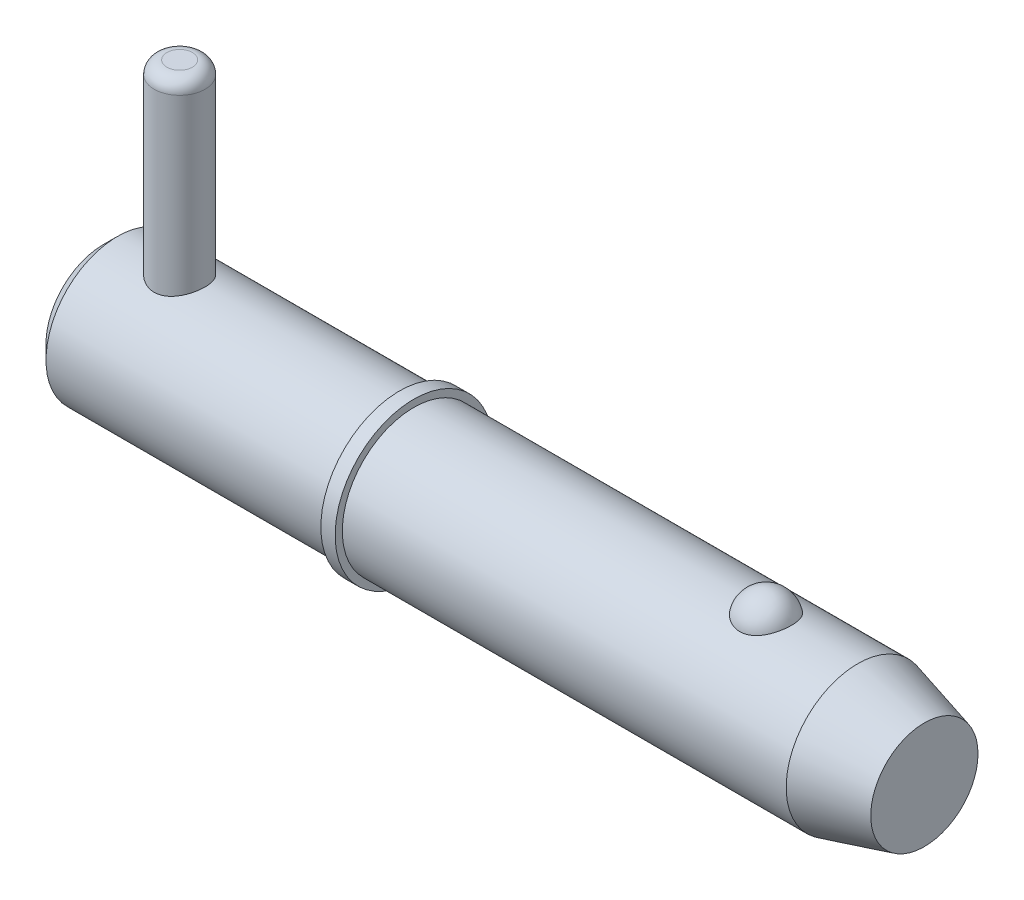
ISO-10303-21;
HEADER;
FILE_DESCRIPTION(('STEP AP214'),'2;1');
FILE_NAME('part.step','',(''),(''),'','','');
FILE_SCHEMA(('AUTOMOTIVE_DESIGN { 1 0 10303 214 1 1 1 1 }'));
ENDSEC;
DATA;
#1=APPLICATION_CONTEXT('core data for automotive mechanical design processes');
#2=APPLICATION_PROTOCOL_DEFINITION('international standard','automotive_design',2000,#1);
#3=PRODUCT_CONTEXT('',#1,'mechanical');
#4=PRODUCT('Part','Part','',(#3));
#5=PRODUCT_RELATED_PRODUCT_CATEGORY('part','',(#4));
#6=PRODUCT_DEFINITION_FORMATION('','',#4);
#7=PRODUCT_DEFINITION_CONTEXT('part definition',#1,'design');
#8=PRODUCT_DEFINITION('design','',#6,#7);
#9=PRODUCT_DEFINITION_SHAPE('','',#8);
#10=(LENGTH_UNIT() NAMED_UNIT(*) SI_UNIT(.MILLI.,.METRE.));
#11=(NAMED_UNIT(*) PLANE_ANGLE_UNIT() SI_UNIT($,.RADIAN.));
#12=(NAMED_UNIT(*) SI_UNIT($,.STERADIAN.) SOLID_ANGLE_UNIT());
#13=UNCERTAINTY_MEASURE_WITH_UNIT(LENGTH_MEASURE(1.E-05),#10,'distance_accuracy_value','');
#14=(GEOMETRIC_REPRESENTATION_CONTEXT(3) GLOBAL_UNCERTAINTY_ASSIGNED_CONTEXT((#13)) GLOBAL_UNIT_ASSIGNED_CONTEXT((#10,
#11,#12)) REPRESENTATION_CONTEXT('',''));
#15=CARTESIAN_POINT('',(0.,0.,0.));
#16=DIRECTION('',(0.,0.,1.));
#17=DIRECTION('',(1.,0.,0.));
#18=AXIS2_PLACEMENT_3D('',#15,#16,#17);
#19=CARTESIAN_POINT('',(5.94,19.845,0.));
#20=DIRECTION('',(0.,-1.,0.));
#21=DIRECTION('',(0.,0.,-1.));
#22=AXIS2_PLACEMENT_3D('',#19,#20,#21);
#23=CYLINDRICAL_SURFACE('',#22,1.98);
#24=CARTESIAN_POINT('',(5.94,-4.565,0.));
#25=DIRECTION('',(0.,1.,0.));
#26=DIRECTION('',(0.,0.,1.));
#27=AXIS2_PLACEMENT_3D('',#24,#25,#26);
#28=CIRCLE('',#27,1.98);
#29=CARTESIAN_POINT('',(5.94,-4.565,1.98));
#30=VERTEX_POINT('',#29);
#31=EDGE_CURVE('P0_E25',#30,#30,#28,.T.);
#32=ORIENTED_EDGE('',*,*,#31,.T.);
#33=EDGE_LOOP('',(#32));
#34=FACE_BOUND('',#33,.T.);
#35=CARTESIAN_POINT('',(5.94,18.855,0.));
#36=DIRECTION('',(0.,1.,0.));
#37=DIRECTION('',(0.,0.,1.));
#38=AXIS2_PLACEMENT_3D('',#35,#36,#37);
#39=CIRCLE('',#38,1.98);
#40=CARTESIAN_POINT('',(5.94,18.855,1.98));
#41=VERTEX_POINT('',#40);
#42=EDGE_CURVE('P0_E29',#41,#41,#39,.F.);
#43=ORIENTED_EDGE('',*,*,#42,.T.);
#44=EDGE_LOOP('',(#43));
#45=FACE_BOUND('',#44,.T.);
#46=ADVANCED_FACE('P0_F14',(#34,#45),#23,.T.);
#47=CARTESIAN_POINT('',(5.94,19.845,0.));
#48=DIRECTION('',(0.,1.,0.));
#49=DIRECTION('',(0.,0.,1.));
#50=AXIS2_PLACEMENT_3D('',#47,#48,#49);
#51=PLANE('',#50);
#52=CARTESIAN_POINT('',(5.94,19.845,0.));
#53=DIRECTION('',(0.,1.,0.));
#54=DIRECTION('',(0.,0.,1.));
#55=AXIS2_PLACEMENT_3D('',#52,#53,#54);
#56=CIRCLE('',#55,0.99);
#57=CARTESIAN_POINT('',(5.94,19.845,0.99));
#58=VERTEX_POINT('',#57);
#59=EDGE_CURVE('P0_E10',#58,#58,#56,.T.);
#60=ORIENTED_EDGE('',*,*,#59,.T.);
#61=EDGE_LOOP('',(#60));
#62=FACE_BOUND('',#61,.T.);
#63=ADVANCED_FACE('P0_F46',(#62),#51,.T.);
#64=CARTESIAN_POINT('',(5.94,-5.555,0.));
#65=DIRECTION('',(0.,1.,0.));
#66=DIRECTION('',(0.,0.,1.));
#67=AXIS2_PLACEMENT_3D('',#64,#65,#66);
#68=PLANE('',#67);
#69=CARTESIAN_POINT('',(5.94,-5.555,0.));
#70=DIRECTION('',(0.,1.,0.));
#71=DIRECTION('',(0.,0.,1.));
#72=AXIS2_PLACEMENT_3D('',#69,#70,#71);
#73=CIRCLE('',#72,0.99);
#74=CARTESIAN_POINT('',(5.94,-5.555,0.99));
#75=VERTEX_POINT('',#74);
#76=EDGE_CURVE('P0_E21',#75,#75,#73,.F.);
#77=ORIENTED_EDGE('',*,*,#76,.T.);
#78=EDGE_LOOP('',(#77));
#79=FACE_BOUND('',#78,.T.);
#80=ADVANCED_FACE('P0_F43',(#79),#68,.F.);
#81=CARTESIAN_POINT('',(5.94,-4.565,0.));
#82=DIRECTION('',(0.,1.,0.));
#83=DIRECTION('',(0.,0.,1.));
#84=AXIS2_PLACEMENT_3D('',#81,#82,#83);
#85=DEGENERATE_TOROIDAL_SURFACE('',#84,0.99,0.99,.T.);
#86=ORIENTED_EDGE('',*,*,#76,.F.);
#87=EDGE_LOOP('',(#86));
#88=FACE_BOUND('',#87,.T.);
#89=ORIENTED_EDGE('',*,*,#31,.F.);
#90=EDGE_LOOP('',(#89));
#91=FACE_BOUND('',#90,.T.);
#92=ADVANCED_FACE('P0_F38',(#88,#91),#85,.T.);
#93=CARTESIAN_POINT('',(5.94,18.855,0.));
#94=DIRECTION('',(0.,1.,0.));
#95=DIRECTION('',(0.,0.,1.));
#96=AXIS2_PLACEMENT_3D('',#93,#94,#95);
#97=DEGENERATE_TOROIDAL_SURFACE('',#96,0.99,0.99,.T.);
#98=ORIENTED_EDGE('',*,*,#42,.F.);
#99=EDGE_LOOP('',(#98));
#100=FACE_BOUND('',#99,.T.);
#101=ORIENTED_EDGE('',*,*,#59,.F.);
#102=EDGE_LOOP('',(#101));
#103=FACE_BOUND('',#102,.T.);
#104=ADVANCED_FACE('P0_F16',(#100,#103),#97,.T.);
#105=CLOSED_SHELL('',(#46,#63,#80,#92,#104));
#106=MANIFOLD_SOLID_BREP('P0_B1',#105);
#107=CARTESIAN_POINT('',(0.,0.,0.));
#108=DIRECTION('',(1.,0.,0.));
#109=DIRECTION('',(0.,0.,-1.));
#110=AXIS2_PLACEMENT_3D('',#107,#108,#109);
#111=CYLINDRICAL_SURFACE('',#110,5.555);
#112=CARTESIAN_POINT('',(58.6171144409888,0.,0.));
#113=DIRECTION('',(1.,0.,0.));
#114=DIRECTION('',(0.,0.,-1.));
#115=AXIS2_PLACEMENT_3D('',#112,#113,#114);
#116=CIRCLE('',#115,5.555);
#117=CARTESIAN_POINT('',(58.6171144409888,0.,-5.555));
#118=VERTEX_POINT('',#117);
#119=EDGE_CURVE('P1_E81',#118,#118,#116,.T.);
#120=ORIENTED_EDGE('',*,*,#119,.F.);
#121=EDGE_LOOP('',(#120));
#122=FACE_BOUND('',#121,.T.);
#123=CARTESIAN_POINT('',(24.13,0.,0.));
#124=DIRECTION('',(1.,0.,0.));
#125=DIRECTION('',(0.,0.,-1.));
#126=AXIS2_PLACEMENT_3D('',#123,#124,#125);
#127=CIRCLE('',#126,5.555);
#128=CARTESIAN_POINT('',(24.13,0.,-5.555));
#129=VERTEX_POINT('',#128);
#130=EDGE_CURVE('P1_E85',#129,#129,#127,.T.);
#131=ORIENTED_EDGE('',*,*,#130,.T.);
#132=EDGE_LOOP('',(#131));
#133=FACE_BOUND('',#132,.T.);
#134=CARTESIAN_POINT('',(51.4986264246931,5.16741224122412,2.03859650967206));
#135=CARTESIAN_POINT('',(51.3929492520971,5.16740893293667,2.03859990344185));
#136=CARTESIAN_POINT('',(51.28729894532,5.17079470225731,2.03008306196));
#137=CARTESIAN_POINT('',(51.0791419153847,5.18392795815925,1.99630721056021));
#138=CARTESIAN_POINT('',(50.9766344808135,5.19367399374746,1.97105201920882));
#139=CARTESIAN_POINT('',(50.7777710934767,5.21839168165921,1.90463997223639));
#140=CARTESIAN_POINT('',(50.6814064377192,5.23335573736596,1.86350622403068));
#141=CARTESIAN_POINT('',(50.4970804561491,5.26688076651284,1.76652592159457));
#142=CARTESIAN_POINT('',(50.4091207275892,5.28544242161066,1.71067657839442));
#143=CARTESIAN_POINT('',(50.2412654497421,5.32479845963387,1.58399959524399));
#144=CARTESIAN_POINT('',(50.1616656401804,5.34564089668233,1.51279545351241));
#145=CARTESIAN_POINT('',(50.0151290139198,5.38697258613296,1.35828584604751));
#146=CARTESIAN_POINT('',(49.948194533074,5.40746177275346,1.27497815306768));
#147=CARTESIAN_POINT('',(49.8256103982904,5.44694508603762,1.09440293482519));
#148=CARTESIAN_POINT('',(49.7705989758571,5.46583143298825,0.996677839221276));
#149=CARTESIAN_POINT('',(49.6769376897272,5.49908030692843,0.792961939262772));
#150=CARTESIAN_POINT('',(49.6382894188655,5.513442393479,0.686970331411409));
#151=CARTESIAN_POINT('',(49.5776807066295,5.53635851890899,0.46801974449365));
#152=CARTESIAN_POINT('',(49.5559725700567,5.54482455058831,0.3549815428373));
#153=CARTESIAN_POINT('',(49.5306362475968,5.55473324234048,0.126595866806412));
#154=CARTESIAN_POINT('',(49.5270077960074,5.55617600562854,0.0112484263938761));
#155=CARTESIAN_POINT('',(49.5378817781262,5.55189984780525,-0.218011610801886));
#156=CARTESIAN_POINT('',(49.5523151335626,5.54620821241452,-0.331928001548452));
#157=CARTESIAN_POINT('',(49.598903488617,5.52828920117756,-0.555544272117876));
#158=CARTESIAN_POINT('',(49.6310588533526,5.5160616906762,-0.665244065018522));
#159=CARTESIAN_POINT('',(49.7124883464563,5.48630779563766,-0.877469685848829));
#160=CARTESIAN_POINT('',(49.7617816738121,5.4687754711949,-0.979987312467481));
#161=CARTESIAN_POINT('',(49.8764785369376,5.43024700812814,-1.1748697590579));
#162=CARTESIAN_POINT('',(49.9418831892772,5.4092506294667,-1.26723387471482));
#163=CARTESIAN_POINT('',(50.0875712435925,5.36600927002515,-1.4394013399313));
#164=CARTESIAN_POINT('',(50.1678859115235,5.34376173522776,-1.51917763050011));
#165=CARTESIAN_POINT('',(50.3414520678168,5.30057971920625,-1.66360338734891));
#166=CARTESIAN_POINT('',(50.434702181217,5.27964509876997,-1.72825445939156));
#167=CARTESIAN_POINT('',(50.6293939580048,5.24205250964,-1.83909478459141));
#168=CARTESIAN_POINT('',(50.7305900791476,5.22530519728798,-1.88568407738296));
#169=CARTESIAN_POINT('',(50.9401552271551,5.1975091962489,-1.96100802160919));
#170=CARTESIAN_POINT('',(51.0485215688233,5.1864583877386,-1.98974931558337));
#171=CARTESIAN_POINT('',(51.2634989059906,5.17184410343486,-2.02742262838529));
#172=CARTESIAN_POINT('',(51.369925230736,5.1679328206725,-2.03727608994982));
#173=CARTESIAN_POINT('',(51.5829925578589,5.16698995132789,-2.03966777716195));
#174=CARTESIAN_POINT('',(51.6896335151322,5.16995704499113,-2.03220932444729));
#175=CARTESIAN_POINT('',(51.8967730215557,5.18222383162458,-2.00071170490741));
#176=CARTESIAN_POINT('',(51.9973599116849,5.19133213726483,-1.97717337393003));
#177=CARTESIAN_POINT('',(52.1930141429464,5.21467637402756,-1.91475248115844));
#178=CARTESIAN_POINT('',(52.2880810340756,5.22891272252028,-1.8758686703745));
#179=CARTESIAN_POINT('',(52.4723711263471,5.26137066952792,-1.7828271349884));
#180=CARTESIAN_POINT('',(52.5614190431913,5.27967329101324,-1.72835124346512));
#181=CARTESIAN_POINT('',(52.7292880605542,5.3181741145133,-1.60597483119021));
#182=CARTESIAN_POINT('',(52.8081068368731,5.33837274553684,-1.53807126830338));
#183=CARTESIAN_POINT('',(52.9575156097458,5.37968287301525,-1.38688970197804));
#184=CARTESIAN_POINT('',(53.0275058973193,5.40079011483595,-1.30301744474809));
#185=CARTESIAN_POINT('',(53.1530125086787,5.44074401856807,-1.12458170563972));
#186=CARTESIAN_POINT('',(53.2085262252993,5.4595902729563,-1.03001630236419));
#187=CARTESIAN_POINT('',(53.3055507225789,5.49369849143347,-0.829439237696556));
#188=CARTESIAN_POINT('',(53.3465483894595,5.50882422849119,-0.723155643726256));
#189=CARTESIAN_POINT('',(53.4111250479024,5.53310911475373,-0.50477271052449));
#190=CARTESIAN_POINT('',(53.4347036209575,5.54226812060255,-0.392673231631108));
#191=CARTESIAN_POINT('',(53.464013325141,5.55370358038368,-0.165459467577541));
#192=CARTESIAN_POINT('',(53.4696884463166,5.55595843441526,-0.0503368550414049));
#193=CARTESIAN_POINT('',(53.462916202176,5.55329317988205,0.179288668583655));
#194=CARTESIAN_POINT('',(53.4504690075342,5.54837313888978,0.293791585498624));
#195=CARTESIAN_POINT('',(53.4077798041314,5.53189037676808,0.518526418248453));
#196=CARTESIAN_POINT('',(53.377598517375,5.5203503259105,0.62877154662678));
#197=CARTESIAN_POINT('',(53.3000962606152,5.49182453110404,0.84231815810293));
#198=CARTESIAN_POINT('',(53.2527743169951,5.47483847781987,0.945619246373));
#199=CARTESIAN_POINT('',(53.1417204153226,5.43710633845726,1.14281571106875));
#200=CARTESIAN_POINT('',(53.077921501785,5.41634501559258,1.23667048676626));
#201=CARTESIAN_POINT('',(52.9353577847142,5.37334572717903,1.41185243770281));
#202=CARTESIAN_POINT('',(52.8565932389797,5.35110778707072,1.49317982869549));
#203=CARTESIAN_POINT('',(52.6864234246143,5.30779474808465,1.64049162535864));
#204=CARTESIAN_POINT('',(52.5951002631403,5.28671324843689,1.70656877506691));
#205=CARTESIAN_POINT('',(52.4017390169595,5.24804852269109,1.82201372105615));
#206=CARTESIAN_POINT('',(52.2997005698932,5.23046541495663,1.87138095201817));
#207=CARTESIAN_POINT('',(52.0836187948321,5.20042692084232,1.95335298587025));
#208=CARTESIAN_POINT('',(51.9692602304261,5.18820192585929,1.98521734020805));
#209=CARTESIAN_POINT('',(51.7361307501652,5.17169804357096,2.02783294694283));
#210=CARTESIAN_POINT('',(51.6173616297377,5.16741595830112,2.03859269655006));
#211=CARTESIAN_POINT('',(51.4986264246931,5.16741224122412,2.03859650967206));
#212=B_SPLINE_CURVE_WITH_KNOTS('',3,(#134,#135,#136,#137,#138,#139,#140,#141,#142,#143,#144,
#145,#146,#147,#148,#149,#150,#151,#152,#153,#154,#155,#156,#157,#158,#159,#160,#161,#162,#163,
#164,#165,#166,#167,#168,#169,#170,#171,#172,#173,#174,#175,#176,#177,#178,#179,#180,#181,#182,
#183,#184,#185,#186,#187,#188,#189,#190,#191,#192,#193,#194,#195,#196,#197,#198,#199,#200,#201,
#202,#203,#204,#205,#206,#207,#208,#209,#210,#211),.UNSPECIFIED.,.T.,.F.,(4,2,2,2,2,2,2,2,2,2,2,
2,2,2,2,2,2,2,2,2,2,2,2,2,2,2,2,2,2,2,2,2,2,2,2,2,2,2,4),(0.,0.316595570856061,
0.633118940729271,0.949183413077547,1.26530783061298,1.59030762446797,1.9153672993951,
2.25495824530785,2.59458224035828,2.93917283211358,3.28375835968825,3.62703002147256,
3.97030875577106,4.31397329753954,4.657661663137,5.00207904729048,5.34645984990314,
5.68270547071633,6.01882587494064,6.33808403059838,6.65728093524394,6.96696376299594,
7.27667180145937,7.59321535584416,7.90983070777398,8.24210387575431,8.57443684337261,
8.91755896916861,9.2606893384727,9.60489211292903,9.94909164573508,10.2921194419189,
10.6351667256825,10.9796305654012,11.3240884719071,11.6663928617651,12.0087088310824,
12.3645679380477,12.7202837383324),.UNSPECIFIED.);
#213=CARTESIAN_POINT('',(51.4986264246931,5.16741224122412,2.03859650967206));
#214=VERTEX_POINT('',#213);
#215=EDGE_CURVE('P1_E35',#214,#214,#212,.T.);
#216=ORIENTED_EDGE('',*,*,#215,.T.);
#217=EDGE_LOOP('',(#216));
#218=FACE_BOUND('',#217,.T.);
#219=ADVANCED_FACE('P1_F13',(#122,#133,#218),#111,.T.);
#220=CARTESIAN_POINT('',(0.,0.,0.));
#221=DIRECTION('',(-1.,0.,0.));
#222=DIRECTION('',(0.,0.,1.));
#223=AXIS2_PLACEMENT_3D('',#220,#221,#222);
#224=PLANE('',#223);
#225=CARTESIAN_POINT('',(0.,0.,0.));
#226=DIRECTION('',(1.,0.,0.));
#227=DIRECTION('',(0.,0.,-1.));
#228=AXIS2_PLACEMENT_3D('',#225,#226,#227);
#229=CIRCLE('',#228,4.444);
#230=CARTESIAN_POINT('',(0.,0.,-4.444));
#231=VERTEX_POINT('',#230);
#232=EDGE_CURVE('P1_E9',#231,#231,#229,.T.);
#233=ORIENTED_EDGE('',*,*,#232,.F.);
#234=EDGE_LOOP('',(#233));
#235=FACE_BOUND('',#234,.T.);
#236=ADVANCED_FACE('P1_F15',(#235),#224,.T.);
#237=CARTESIAN_POINT('',(1.111,0.,0.));
#238=DIRECTION('',(1.,0.,0.));
#239=DIRECTION('',(0.,0.,-1.));
#240=AXIS2_PLACEMENT_3D('',#237,#238,#239);
#241=CONICAL_SURFACE('',#240,5.555,0.78539816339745);
#242=ORIENTED_EDGE('',*,*,#232,.T.);
#243=EDGE_LOOP('',(#242));
#244=FACE_BOUND('',#243,.T.);
#245=CARTESIAN_POINT('',(1.111,0.,0.));
#246=DIRECTION('',(1.,0.,0.));
#247=DIRECTION('',(0.,0.,-1.));
#248=AXIS2_PLACEMENT_3D('',#245,#246,#247);
#249=CIRCLE('',#248,5.555);
#250=CARTESIAN_POINT('',(1.111,0.,-5.555));
#251=VERTEX_POINT('',#250);
#252=EDGE_CURVE('P1_E26',#251,#251,#249,.T.);
#253=ORIENTED_EDGE('',*,*,#252,.F.);
#254=EDGE_LOOP('',(#253));
#255=FACE_BOUND('',#254,.T.);
#256=ADVANCED_FACE('P1_F77',(#244,#255),#241,.T.);
#257=CARTESIAN_POINT('',(0.,0.,0.));
#258=DIRECTION('',(1.,0.,0.));
#259=DIRECTION('',(0.,0.,-1.));
#260=AXIS2_PLACEMENT_3D('',#257,#258,#259);
#261=CYLINDRICAL_SURFACE('',#260,5.555);
#262=CARTESIAN_POINT('',(5.94,-5.19014691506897,1.98));
#263=CARTESIAN_POINT('',(5.83264687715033,-5.19014494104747,1.98000226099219));
#264=CARTESIAN_POINT('',(5.7253094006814,-5.19351395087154,1.97123988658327));
#265=CARTESIAN_POINT('',(5.51384517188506,-5.20654291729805,1.93656219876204));
#266=CARTESIAN_POINT('',(5.40971858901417,-5.21620320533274,1.91064598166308));
#267=CARTESIAN_POINT('',(5.20778082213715,-5.24058443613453,1.84271148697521));
#268=CARTESIAN_POINT('',(5.10995634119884,-5.25529427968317,1.80072850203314));
#269=CARTESIAN_POINT('',(4.92270352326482,-5.28810012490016,1.70197537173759));
#270=CARTESIAN_POINT('',(4.83327743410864,-5.3061970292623,1.64520128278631));
#271=CARTESIAN_POINT('',(4.66135184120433,-5.34464714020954,1.51575187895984));
#272=CARTESIAN_POINT('',(4.57928277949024,-5.36506222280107,1.44252311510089));
#273=CARTESIAN_POINT('',(4.42829115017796,-5.40532920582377,1.28342047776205));
#274=CARTESIAN_POINT('',(4.35937105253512,-5.42518099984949,1.19754423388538));
#275=CARTESIAN_POINT('',(4.23461605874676,-5.46281133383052,1.01237205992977));
#276=CARTESIAN_POINT('',(4.17924129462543,-5.48050875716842,0.912748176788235));
#277=CARTESIAN_POINT('',(4.0862117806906,-5.51109938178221,0.70485824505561));
#278=CARTESIAN_POINT('',(4.0485515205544,-5.52399407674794,0.596594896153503));
#279=CARTESIAN_POINT('',(3.99350662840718,-5.54308759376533,0.379019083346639));
#280=CARTESIAN_POINT('',(3.97538263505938,-5.54952987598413,0.269915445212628));
#281=CARTESIAN_POINT('',(3.95756405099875,-5.55586205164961,0.0500378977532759));
#282=CARTESIAN_POINT('',(3.95786404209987,-5.55575387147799,-0.060735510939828));
#283=CARTESIAN_POINT('',(3.97643665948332,-5.54915684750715,-0.275539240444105));
#284=CARTESIAN_POINT('',(3.99390415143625,-5.54295384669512,-0.379649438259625));
#285=CARTESIAN_POINT('',(4.0449721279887,-5.52523170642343,-0.583350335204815));
#286=CARTESIAN_POINT('',(4.07857373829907,-5.51371219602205,-0.682940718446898));
#287=CARTESIAN_POINT('',(4.16137312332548,-5.4863099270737,-0.876423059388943));
#288=CARTESIAN_POINT('',(4.2107826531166,-5.47036834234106,-0.970215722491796));
#289=CARTESIAN_POINT('',(4.32361427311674,-5.43575653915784,-1.1484017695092));
#290=CARTESIAN_POINT('',(4.38704062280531,-5.41708549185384,-1.23279228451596));
#291=CARTESIAN_POINT('',(4.53006791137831,-5.37778429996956,-1.39454579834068));
#292=CARTESIAN_POINT('',(4.61035105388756,-5.35710277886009,-1.4712940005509));
#293=CARTESIAN_POINT('',(4.78279835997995,-5.31692766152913,-1.6104545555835));
#294=CARTESIAN_POINT('',(4.874964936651,-5.29743430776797,-1.67286398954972));
#295=CARTESIAN_POINT('',(5.07076688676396,-5.26153775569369,-1.78259698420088));
#296=CARTESIAN_POINT('',(5.17458163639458,-5.24519780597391,-1.8296227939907));
#297=CARTESIAN_POINT('',(5.38938990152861,-5.21818744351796,-1.90530278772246));
#298=CARTESIAN_POINT('',(5.50037985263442,-5.20751423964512,-1.93396601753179));
#299=CARTESIAN_POINT('',(5.72036376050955,-5.19369176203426,-1.97077654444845));
#300=CARTESIAN_POINT('',(5.82917370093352,-5.19018851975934,-1.97989015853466));
#301=CARTESIAN_POINT('',(6.04680100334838,-5.19010609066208,-1.98010779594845));
#302=CARTESIAN_POINT('',(6.15561835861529,-5.19352540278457,-1.97121572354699));
#303=CARTESIAN_POINT('',(6.36548036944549,-5.20654623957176,-1.93654727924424));
#304=CARTESIAN_POINT('',(6.46666051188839,-5.21588705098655,-1.91148218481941));
#305=CARTESIAN_POINT('',(6.66334537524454,-5.23939939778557,-1.84605494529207));
#306=CARTESIAN_POINT('',(6.75884899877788,-5.25357186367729,-1.8056898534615));
#307=CARTESIAN_POINT('',(6.94517989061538,-5.28576258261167,-1.70921153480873));
#308=CARTESIAN_POINT('',(7.03572661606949,-5.30389804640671,-1.65259670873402));
#309=CARTESIAN_POINT('',(7.20638087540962,-5.34176077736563,-1.52577523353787));
#310=CARTESIAN_POINT('',(7.28648490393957,-5.36148857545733,-1.45556404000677));
#311=CARTESIAN_POINT('',(7.43864697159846,-5.40165494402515,-1.2988614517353));
#312=CARTESIAN_POINT('',(7.50999887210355,-5.42207106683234,-1.21167640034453));
#313=CARTESIAN_POINT('',(7.63712639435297,-5.46023601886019,-1.026066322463));
#314=CARTESIAN_POINT('',(7.69290228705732,-5.47798489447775,-0.927641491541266));
#315=CARTESIAN_POINT('',(7.78684673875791,-5.50876590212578,-0.722633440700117));
#316=CARTESIAN_POINT('',(7.82510508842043,-5.52182201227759,-0.616095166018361));
#317=CARTESIAN_POINT('',(7.88297051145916,-5.54184206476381,-0.397530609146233));
#318=CARTESIAN_POINT('',(7.90258540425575,-5.5488085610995,-0.285506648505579));
#319=CARTESIAN_POINT('',(7.9218262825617,-5.55564472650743,-0.065566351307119));
#320=CARTESIAN_POINT('',(7.92245987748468,-5.55587212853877,0.0422515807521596));
#321=CARTESIAN_POINT('',(7.90626329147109,-5.55011340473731,0.256387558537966));
#322=CARTESIAN_POINT('',(7.88943488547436,-5.54412791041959,0.362705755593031));
#323=CARTESIAN_POINT('',(7.83948457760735,-5.52676548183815,0.568649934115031));
#324=CARTESIAN_POINT('',(7.8067003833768,-5.51550046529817,0.668367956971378));
#325=CARTESIAN_POINT('',(7.72609369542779,-5.48874437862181,0.860911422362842));
#326=CARTESIAN_POINT('',(7.67826838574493,-5.47325251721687,0.953735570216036));
#327=CARTESIAN_POINT('',(7.56675024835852,-5.43884382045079,1.13391068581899));
#328=CARTESIAN_POINT('',(7.50249968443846,-5.41981485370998,1.22089468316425));
#329=CARTESIAN_POINT('',(7.36086495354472,-5.38069275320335,1.38316665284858));
#330=CARTESIAN_POINT('',(7.28347630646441,-5.36059925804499,1.45845061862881));
#331=CARTESIAN_POINT('',(7.11347587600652,-5.32048380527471,1.59876646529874));
#332=CARTESIAN_POINT('',(7.02032386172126,-5.30050854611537,1.66315951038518));
#333=CARTESIAN_POINT('',(6.82388804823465,-5.26398994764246,1.77536801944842));
#334=CARTESIAN_POINT('',(6.7206049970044,-5.24744635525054,1.82318470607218));
#335=CARTESIAN_POINT('',(6.50639706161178,-5.21987969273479,1.90068230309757));
#336=CARTESIAN_POINT('',(6.3954529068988,-5.20887116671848,1.93031547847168));
#337=CARTESIAN_POINT('',(6.16966522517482,-5.19400760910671,1.96996824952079));
#338=CARTESIAN_POINT('',(6.05482366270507,-5.19014902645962,1.97999758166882));
#339=CARTESIAN_POINT('',(5.94,-5.19014691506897,1.98));
#340=B_SPLINE_CURVE_WITH_KNOTS('',3,(#262,#263,#264,#265,#266,#267,#268,#269,#270,#271,#272,
#273,#274,#275,#276,#277,#278,#279,#280,#281,#282,#283,#284,#285,#286,#287,#288,#289,#290,#291,
#292,#293,#294,#295,#296,#297,#298,#299,#300,#301,#302,#303,#304,#305,#306,#307,#308,#309,#310,
#311,#312,#313,#314,#315,#316,#317,#318,#319,#320,#321,#322,#323,#324,#325,#326,#327,#328,#329,
#330,#331,#332,#333,#334,#335,#336,#337,#338,#339),.UNSPECIFIED.,.T.,.F.,(4,2,2,2,2,2,2,2,2,2,2,
2,2,2,2,2,2,2,2,2,2,2,2,2,2,2,2,2,2,2,2,2,2,2,2,2,2,2,4),(0.,0.321632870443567,
0.643282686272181,0.964229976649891,1.28526292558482,1.61937087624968,1.9535415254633,
2.29784481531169,2.64204093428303,2.97269632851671,3.30325448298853,3.61901541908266,
3.93479838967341,4.25500220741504,4.57530346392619,4.91268648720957,5.25013812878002,
5.59378026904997,5.93725299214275,6.26331481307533,6.58930593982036,6.90185604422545,
7.21446637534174,7.53801472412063,7.86167140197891,8.20353561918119,8.54539388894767,
8.88547970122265,9.22542281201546,9.54728637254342,9.86911722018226,10.1844146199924,
10.4997710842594,10.827730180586,11.1558013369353,11.499115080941,11.8424034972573,
12.1865892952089,12.5306041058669),.UNSPECIFIED.);
#341=CARTESIAN_POINT('',(5.94,-5.19014691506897,1.98));
#342=VERTEX_POINT('',#341);
#343=EDGE_CURVE('P1_E17',#342,#342,#340,.T.);
#344=ORIENTED_EDGE('',*,*,#343,.F.);
#345=EDGE_LOOP('',(#344));
#346=FACE_BOUND('',#345,.T.);
#347=CARTESIAN_POINT('',(5.94,5.19014691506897,1.98));
#348=CARTESIAN_POINT('',(6.04735312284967,5.19014494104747,1.98000226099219));
#349=CARTESIAN_POINT('',(6.1546905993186,5.19351395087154,1.97123988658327));
#350=CARTESIAN_POINT('',(6.36615482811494,5.20654291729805,1.93656219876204));
#351=CARTESIAN_POINT('',(6.47028141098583,5.21620320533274,1.91064598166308));
#352=CARTESIAN_POINT('',(6.67221917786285,5.24058443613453,1.84271148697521));
#353=CARTESIAN_POINT('',(6.77004365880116,5.25529427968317,1.80072850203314));
#354=CARTESIAN_POINT('',(6.95729647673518,5.28810012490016,1.70197537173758));
#355=CARTESIAN_POINT('',(7.04672256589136,5.3061970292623,1.64520128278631));
#356=CARTESIAN_POINT('',(7.21864815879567,5.34464714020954,1.51575187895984));
#357=CARTESIAN_POINT('',(7.30071722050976,5.36506222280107,1.44252311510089));
#358=CARTESIAN_POINT('',(7.45170884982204,5.40532920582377,1.28342047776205));
#359=CARTESIAN_POINT('',(7.52062894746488,5.42518099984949,1.19754423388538));
#360=CARTESIAN_POINT('',(7.64538394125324,5.46281133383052,1.01237205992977));
#361=CARTESIAN_POINT('',(7.70075870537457,5.48050875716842,0.912748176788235));
#362=CARTESIAN_POINT('',(7.7937882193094,5.51109938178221,0.704858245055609));
#363=CARTESIAN_POINT('',(7.8314484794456,5.52399407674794,0.596594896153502));
#364=CARTESIAN_POINT('',(7.88649337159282,5.54308759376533,0.379019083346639));
#365=CARTESIAN_POINT('',(7.90461736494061,5.54952987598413,0.269915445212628));
#366=CARTESIAN_POINT('',(7.92243594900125,5.55586205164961,0.0500378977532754));
#367=CARTESIAN_POINT('',(7.92213595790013,5.55575387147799,-0.0607355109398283));
#368=CARTESIAN_POINT('',(7.90356334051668,5.54915684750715,-0.275539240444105));
#369=CARTESIAN_POINT('',(7.88609584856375,5.54295384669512,-0.379649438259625));
#370=CARTESIAN_POINT('',(7.8350278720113,5.52523170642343,-0.583350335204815));
#371=CARTESIAN_POINT('',(7.80142626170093,5.51371219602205,-0.682940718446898));
#372=CARTESIAN_POINT('',(7.71862687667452,5.4863099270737,-0.876423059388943));
#373=CARTESIAN_POINT('',(7.6692173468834,5.47036834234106,-0.970215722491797));
#374=CARTESIAN_POINT('',(7.55638572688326,5.43575653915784,-1.1484017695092));
#375=CARTESIAN_POINT('',(7.49295937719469,5.41708549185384,-1.23279228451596));
#376=CARTESIAN_POINT('',(7.34993208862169,5.37778429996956,-1.39454579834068));
#377=CARTESIAN_POINT('',(7.26964894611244,5.35710277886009,-1.4712940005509));
#378=CARTESIAN_POINT('',(7.09720164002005,5.31692766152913,-1.6104545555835));
#379=CARTESIAN_POINT('',(7.00503506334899,5.29743430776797,-1.67286398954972));
#380=CARTESIAN_POINT('',(6.80923311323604,5.26153775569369,-1.78259698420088));
#381=CARTESIAN_POINT('',(6.70541836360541,5.24519780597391,-1.8296227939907));
#382=CARTESIAN_POINT('',(6.49061009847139,5.21818744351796,-1.90530278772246));
#383=CARTESIAN_POINT('',(6.37962014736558,5.20751423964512,-1.93396601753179));
#384=CARTESIAN_POINT('',(6.15963623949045,5.19369176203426,-1.97077654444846));
#385=CARTESIAN_POINT('',(6.05082629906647,5.19018851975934,-1.97989015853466));
#386=CARTESIAN_POINT('',(5.83319899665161,5.19010609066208,-1.98010779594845));
#387=CARTESIAN_POINT('',(5.7243816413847,5.19352540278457,-1.97121572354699));
#388=CARTESIAN_POINT('',(5.5145196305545,5.20654623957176,-1.93654727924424));
#389=CARTESIAN_POINT('',(5.4133394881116,5.21588705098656,-1.91148218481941));
#390=CARTESIAN_POINT('',(5.21665462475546,5.23939939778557,-1.84605494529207));
#391=CARTESIAN_POINT('',(5.12115100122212,5.25357186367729,-1.8056898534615));
#392=CARTESIAN_POINT('',(4.93482010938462,5.28576258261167,-1.70921153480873));
#393=CARTESIAN_POINT('',(4.84427338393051,5.30389804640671,-1.65259670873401));
#394=CARTESIAN_POINT('',(4.67361912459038,5.34176077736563,-1.52577523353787));
#395=CARTESIAN_POINT('',(4.59351509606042,5.36148857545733,-1.45556404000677));
#396=CARTESIAN_POINT('',(4.44135302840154,5.40165494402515,-1.2988614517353));
#397=CARTESIAN_POINT('',(4.37000112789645,5.42207106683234,-1.21167640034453));
#398=CARTESIAN_POINT('',(4.24287360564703,5.46023601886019,-1.026066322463));
#399=CARTESIAN_POINT('',(4.18709771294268,5.47798489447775,-0.927641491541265));
#400=CARTESIAN_POINT('',(4.09315326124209,5.50876590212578,-0.722633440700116));
#401=CARTESIAN_POINT('',(4.05489491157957,5.52182201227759,-0.61609516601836));
#402=CARTESIAN_POINT('',(3.99702948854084,5.54184206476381,-0.397530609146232));
#403=CARTESIAN_POINT('',(3.97741459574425,5.5488085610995,-0.285506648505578));
#404=CARTESIAN_POINT('',(3.9581737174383,5.55564472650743,-0.0655663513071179));
#405=CARTESIAN_POINT('',(3.95754012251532,5.55587212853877,0.0422515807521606));
#406=CARTESIAN_POINT('',(3.97373670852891,5.55011340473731,0.256387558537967));
#407=CARTESIAN_POINT('',(3.99056511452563,5.54412791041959,0.362705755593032));
#408=CARTESIAN_POINT('',(4.04051542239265,5.52676548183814,0.568649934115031));
#409=CARTESIAN_POINT('',(4.07329961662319,5.51550046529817,0.668367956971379));
#410=CARTESIAN_POINT('',(4.15390630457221,5.48874437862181,0.860911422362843));
#411=CARTESIAN_POINT('',(4.20173161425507,5.47325251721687,0.953735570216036));
#412=CARTESIAN_POINT('',(4.31324975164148,5.43884382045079,1.13391068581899));
#413=CARTESIAN_POINT('',(4.37750031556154,5.41981485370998,1.22089468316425));
#414=CARTESIAN_POINT('',(4.51913504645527,5.38069275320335,1.38316665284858));
#415=CARTESIAN_POINT('',(4.59652369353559,5.36059925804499,1.45845061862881));
#416=CARTESIAN_POINT('',(4.76652412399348,5.32048380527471,1.59876646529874));
#417=CARTESIAN_POINT('',(4.85967613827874,5.30050854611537,1.66315951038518));
#418=CARTESIAN_POINT('',(5.05611195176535,5.26398994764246,1.77536801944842));
#419=CARTESIAN_POINT('',(5.1593950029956,5.24744635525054,1.82318470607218));
#420=CARTESIAN_POINT('',(5.37360293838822,5.21987969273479,1.90068230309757));
#421=CARTESIAN_POINT('',(5.4845470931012,5.20887116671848,1.93031547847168));
#422=CARTESIAN_POINT('',(5.71033477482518,5.19400760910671,1.96996824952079));
#423=CARTESIAN_POINT('',(5.82517633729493,5.19014902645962,1.97999758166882));
#424=CARTESIAN_POINT('',(5.94,5.19014691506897,1.98));
#425=B_SPLINE_CURVE_WITH_KNOTS('',3,(#347,#348,#349,#350,#351,#352,#353,#354,#355,#356,#357,
#358,#359,#360,#361,#362,#363,#364,#365,#366,#367,#368,#369,#370,#371,#372,#373,#374,#375,#376,
#377,#378,#379,#380,#381,#382,#383,#384,#385,#386,#387,#388,#389,#390,#391,#392,#393,#394,#395,
#396,#397,#398,#399,#400,#401,#402,#403,#404,#405,#406,#407,#408,#409,#410,#411,#412,#413,#414,
#415,#416,#417,#418,#419,#420,#421,#422,#423,#424),.UNSPECIFIED.,.T.,.F.,(4,2,2,2,2,2,2,2,2,2,2,
2,2,2,2,2,2,2,2,2,2,2,2,2,2,2,2,2,2,2,2,2,2,2,2,2,2,2,4),(0.,0.321632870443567,
0.643282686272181,0.964229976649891,1.28526292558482,1.61937087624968,1.9535415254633,
2.29784481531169,2.64204093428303,2.97269632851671,3.30325448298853,3.61901541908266,
3.93479838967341,4.25500220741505,4.57530346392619,4.91268648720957,5.25013812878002,
5.59378026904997,5.93725299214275,6.26331481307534,6.58930593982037,6.90185604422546,
7.21446637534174,7.53801472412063,7.86167140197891,8.20353561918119,8.54539388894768,
8.88547970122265,9.22542281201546,9.54728637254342,9.86911722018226,10.1844146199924,
10.4997710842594,10.827730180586,11.1558013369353,11.499115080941,11.8424034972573,
12.1865892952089,12.5306041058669),.UNSPECIFIED.);
#426=CARTESIAN_POINT('',(5.94,5.19014691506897,1.98));
#427=VERTEX_POINT('',#426);
#428=EDGE_CURVE('P1_E43',#427,#427,#425,.T.);
#429=ORIENTED_EDGE('',*,*,#428,.F.);
#430=EDGE_LOOP('',(#429));
#431=FACE_BOUND('',#430,.T.);
#432=ORIENTED_EDGE('',*,*,#252,.T.);
#433=EDGE_LOOP('',(#432));
#434=FACE_BOUND('',#433,.T.);
#435=CARTESIAN_POINT('',(23.019,0.,0.));
#436=DIRECTION('',(1.,0.,0.));
#437=DIRECTION('',(0.,0.,-1.));
#438=AXIS2_PLACEMENT_3D('',#435,#436,#437);
#439=CIRCLE('',#438,5.555);
#440=CARTESIAN_POINT('',(23.019,0.,-5.555));
#441=VERTEX_POINT('',#440);
#442=EDGE_CURVE('P1_E31',#441,#441,#439,.T.);
#443=ORIENTED_EDGE('',*,*,#442,.F.);
#444=EDGE_LOOP('',(#443));
#445=FACE_BOUND('',#444,.T.);
#446=ADVANCED_FACE('P1_F103',(#346,#431,#434,#445),#261,.T.);
#447=CARTESIAN_POINT('',(23.019,5.555,0.));
#448=DIRECTION('',(-1.,0.,0.));
#449=DIRECTION('',(0.,0.,1.));
#450=AXIS2_PLACEMENT_3D('',#447,#448,#449);
#451=PLANE('',#450);
#452=ORIENTED_EDGE('',*,*,#442,.T.);
#453=EDGE_LOOP('',(#452));
#454=FACE_BOUND('',#453,.T.);
#455=CARTESIAN_POINT('',(23.019,0.,0.));
#456=DIRECTION('',(1.,0.,0.));
#457=DIRECTION('',(0.,0.,-1.));
#458=AXIS2_PLACEMENT_3D('',#455,#456,#457);
#459=CIRCLE('',#458,6.1105);
#460=CARTESIAN_POINT('',(23.019,0.,-6.1105));
#461=VERTEX_POINT('',#460);
#462=EDGE_CURVE('P1_E91',#461,#461,#459,.T.);
#463=ORIENTED_EDGE('',*,*,#462,.F.);
#464=EDGE_LOOP('',(#463));
#465=FACE_BOUND('',#464,.T.);
#466=ADVANCED_FACE('P1_F100',(#454,#465),#451,.T.);
#467=CARTESIAN_POINT('',(0.,0.,0.));
#468=DIRECTION('',(1.,0.,0.));
#469=DIRECTION('',(0.,0.,-1.));
#470=AXIS2_PLACEMENT_3D('',#467,#468,#469);
#471=CYLINDRICAL_SURFACE('',#470,6.1105);
#472=ORIENTED_EDGE('',*,*,#462,.T.);
#473=EDGE_LOOP('',(#472));
#474=FACE_BOUND('',#473,.T.);
#475=CARTESIAN_POINT('',(24.13,0.,0.));
#476=DIRECTION('',(1.,0.,0.));
#477=DIRECTION('',(0.,0.,-1.));
#478=AXIS2_PLACEMENT_3D('',#475,#476,#477);
#479=CIRCLE('',#478,6.1105);
#480=CARTESIAN_POINT('',(24.13,0.,-6.1105));
#481=VERTEX_POINT('',#480);
#482=EDGE_CURVE('P1_E88',#481,#481,#479,.T.);
#483=ORIENTED_EDGE('',*,*,#482,.F.);
#484=EDGE_LOOP('',(#483));
#485=FACE_BOUND('',#484,.T.);
#486=ADVANCED_FACE('P1_F68',(#474,#485),#471,.T.);
#487=CARTESIAN_POINT('',(24.13,6.1105,0.));
#488=DIRECTION('',(1.,0.,0.));
#489=DIRECTION('',(0.,0.,-1.));
#490=AXIS2_PLACEMENT_3D('',#487,#488,#489);
#491=PLANE('',#490);
#492=ORIENTED_EDGE('',*,*,#482,.T.);
#493=EDGE_LOOP('',(#492));
#494=FACE_BOUND('',#493,.T.);
#495=ORIENTED_EDGE('',*,*,#130,.F.);
#496=EDGE_LOOP('',(#495));
#497=FACE_BOUND('',#496,.T.);
#498=ADVANCED_FACE('P1_F62',(#494,#497),#491,.T.);
#499=CARTESIAN_POINT('',(63.8,0.,0.));
#500=DIRECTION('',(-1.,0.,0.));
#501=DIRECTION('',(0.,0.,1.));
#502=AXIS2_PLACEMENT_3D('',#499,#500,#501);
#503=CONICAL_SURFACE('',#502,4.16625000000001,0.26179938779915);
#504=ORIENTED_EDGE('',*,*,#119,.T.);
#505=EDGE_LOOP('',(#504));
#506=FACE_BOUND('',#505,.T.);
#507=CARTESIAN_POINT('',(63.8,0.,0.));
#508=DIRECTION('',(1.,0.,0.));
#509=DIRECTION('',(0.,0.,-1.));
#510=AXIS2_PLACEMENT_3D('',#507,#508,#509);
#511=CIRCLE('',#510,4.16625000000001);
#512=CARTESIAN_POINT('',(63.8,0.,-4.16625000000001));
#513=VERTEX_POINT('',#512);
#514=EDGE_CURVE('P1_E42',#513,#513,#511,.T.);
#515=ORIENTED_EDGE('',*,*,#514,.F.);
#516=EDGE_LOOP('',(#515));
#517=FACE_BOUND('',#516,.T.);
#518=ADVANCED_FACE('P1_F59',(#506,#517),#503,.T.);
#519=CARTESIAN_POINT('',(63.8,4.16625000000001,0.));
#520=DIRECTION('',(1.,0.,0.));
#521=DIRECTION('',(0.,0.,-1.));
#522=AXIS2_PLACEMENT_3D('',#519,#520,#521);
#523=PLANE('',#522);
#524=ORIENTED_EDGE('',*,*,#514,.T.);
#525=EDGE_LOOP('',(#524));
#526=FACE_BOUND('',#525,.T.);
#527=ADVANCED_FACE('P1_F55',(#526),#523,.T.);
#528=CARTESIAN_POINT('',(51.4986264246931,4.9995,0.));
#529=DIRECTION('',(-1.,0.,0.));
#530=DIRECTION('',(0.,1.,0.));
#531=AXIS2_PLACEMENT_3D('',#528,#529,#530);
#532=SPHERICAL_SURFACE('',#531,2.04550000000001);
#533=ORIENTED_EDGE('',*,*,#215,.F.);
#534=EDGE_LOOP('',(#533));
#535=FACE_BOUND('',#534,.T.);
#536=ADVANCED_FACE('P1_F50',(#535),#532,.T.);
#537=CARTESIAN_POINT('',(5.94,-6.1105,0.));
#538=DIRECTION('',(0.,1.,0.));
#539=DIRECTION('',(0.,0.,1.));
#540=AXIS2_PLACEMENT_3D('',#537,#538,#539);
#541=CYLINDRICAL_SURFACE('',#540,1.98);
#542=ORIENTED_EDGE('',*,*,#343,.T.);
#543=EDGE_LOOP('',(#542));
#544=FACE_BOUND('',#543,.T.);
#545=ORIENTED_EDGE('',*,*,#428,.T.);
#546=EDGE_LOOP('',(#545));
#547=FACE_BOUND('',#546,.T.);
#548=ADVANCED_FACE('P1_F54',(#544,#547),#541,.F.);
#549=CLOSED_SHELL('',(#219,#236,#256,#446,#466,#486,#498,#518,#527,#536,#548));
#550=MANIFOLD_SOLID_BREP('P1_B1',#549);
#551=ADVANCED_BREP_SHAPE_REPRESENTATION('',(#18,#106,#550),#14);
#552=SHAPE_DEFINITION_REPRESENTATION(#9,#551);
ENDSEC;
END-ISO-10303-21;
